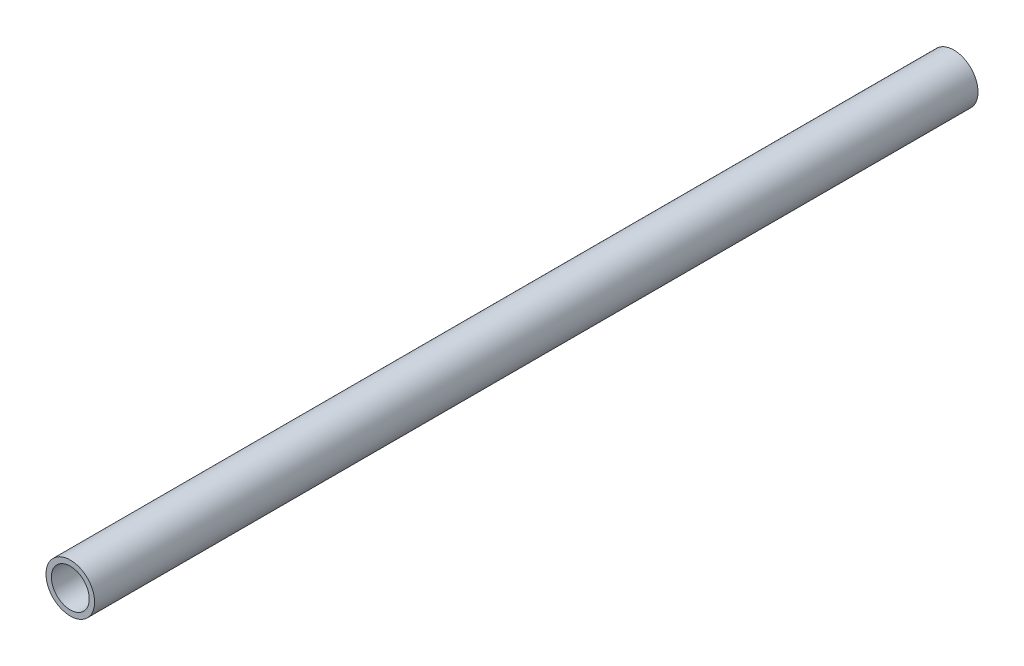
ISO-10303-21;
HEADER;
FILE_DESCRIPTION(('STEP AP214'),'2;1');
FILE_NAME('part.step','',(''),(''),'','','');
FILE_SCHEMA(('AUTOMOTIVE_DESIGN { 1 0 10303 214 1 1 1 1 }'));
ENDSEC;
DATA;
#1=APPLICATION_CONTEXT('core data for automotive mechanical design processes');
#2=APPLICATION_PROTOCOL_DEFINITION('international standard','automotive_design',2000,#1);
#3=PRODUCT_CONTEXT('',#1,'mechanical');
#4=PRODUCT('Part','Part','',(#3));
#5=PRODUCT_RELATED_PRODUCT_CATEGORY('part','',(#4));
#6=PRODUCT_DEFINITION_FORMATION('','',#4);
#7=PRODUCT_DEFINITION_CONTEXT('part definition',#1,'design');
#8=PRODUCT_DEFINITION('design','',#6,#7);
#9=PRODUCT_DEFINITION_SHAPE('','',#8);
#10=(LENGTH_UNIT() NAMED_UNIT(*) SI_UNIT(.MILLI.,.METRE.));
#11=(NAMED_UNIT(*) PLANE_ANGLE_UNIT() SI_UNIT($,.RADIAN.));
#12=(NAMED_UNIT(*) SI_UNIT($,.STERADIAN.) SOLID_ANGLE_UNIT());
#13=UNCERTAINTY_MEASURE_WITH_UNIT(LENGTH_MEASURE(1.E-05),#10,'distance_accuracy_value','');
#14=(GEOMETRIC_REPRESENTATION_CONTEXT(3) GLOBAL_UNCERTAINTY_ASSIGNED_CONTEXT((#13)) GLOBAL_UNIT_ASSIGNED_CONTEXT((#10,
#11,#12)) REPRESENTATION_CONTEXT('',''));
#15=CARTESIAN_POINT('',(0.,0.,0.));
#16=DIRECTION('',(0.,0.,1.));
#17=DIRECTION('',(1.,0.,0.));
#18=AXIS2_PLACEMENT_3D('',#15,#16,#17);
#19=CARTESIAN_POINT('',(0.,0.,304.8));
#20=DIRECTION('',(0.,0.,1.));
#21=DIRECTION('',(1.,0.,0.));
#22=AXIS2_PLACEMENT_3D('',#19,#20,#21);
#23=PLANE('',#22);
#24=CARTESIAN_POINT('',(0.,0.,304.8));
#25=DIRECTION('',(0.,0.,1.));
#26=DIRECTION('',(1.,0.,0.));
#27=AXIS2_PLACEMENT_3D('',#24,#25,#26);
#28=CIRCLE('',#27,16.764);
#29=CARTESIAN_POINT('',(-16.764,0.,304.8));
#30=VERTEX_POINT('',#29);
#31=EDGE_CURVE('E10',#30,#30,#28,.T.);
#32=ORIENTED_EDGE('',*,*,#31,.T.);
#33=EDGE_LOOP('',(#32));
#34=FACE_BOUND('',#33,.T.);
#35=CARTESIAN_POINT('',(0.,0.,304.8));
#36=DIRECTION('',(0.,0.,1.));
#37=DIRECTION('',(1.,0.,0.));
#38=AXIS2_PLACEMENT_3D('',#35,#36,#37);
#39=CIRCLE('',#38,13.081);
#40=CARTESIAN_POINT('',(-13.081,0.,304.8));
#41=VERTEX_POINT('',#40);
#42=EDGE_CURVE('E38',#41,#41,#39,.T.);
#43=ORIENTED_EDGE('',*,*,#42,.F.);
#44=EDGE_LOOP('',(#43));
#45=FACE_BOUND('',#44,.T.);
#46=ADVANCED_FACE('F27',(#34,#45),#23,.T.);
#47=CARTESIAN_POINT('',(0.,0.,-304.8));
#48=DIRECTION('',(0.,0.,1.));
#49=DIRECTION('',(1.,0.,0.));
#50=AXIS2_PLACEMENT_3D('',#47,#48,#49);
#51=PLANE('',#50);
#52=CARTESIAN_POINT('',(0.,0.,-304.8));
#53=DIRECTION('',(0.,0.,1.));
#54=DIRECTION('',(1.,0.,0.));
#55=AXIS2_PLACEMENT_3D('',#52,#53,#54);
#56=CIRCLE('',#55,16.764);
#57=CARTESIAN_POINT('',(-16.764,0.,-304.8));
#58=VERTEX_POINT('',#57);
#59=EDGE_CURVE('E34',#58,#58,#56,.T.);
#60=ORIENTED_EDGE('',*,*,#59,.F.);
#61=EDGE_LOOP('',(#60));
#62=FACE_BOUND('',#61,.T.);
#63=CARTESIAN_POINT('',(0.,0.,-304.8));
#64=DIRECTION('',(0.,0.,1.));
#65=DIRECTION('',(1.,0.,0.));
#66=AXIS2_PLACEMENT_3D('',#63,#64,#65);
#67=CIRCLE('',#66,13.081);
#68=CARTESIAN_POINT('',(-13.081,0.,-304.8));
#69=VERTEX_POINT('',#68);
#70=EDGE_CURVE('E42',#69,#69,#67,.T.);
#71=ORIENTED_EDGE('',*,*,#70,.T.);
#72=EDGE_LOOP('',(#71));
#73=FACE_BOUND('',#72,.T.);
#74=ADVANCED_FACE('F48',(#62,#73),#51,.F.);
#75=CARTESIAN_POINT('',(0.,0.,304.8));
#76=DIRECTION('',(0.,0.,-1.));
#77=DIRECTION('',(-1.,0.,0.));
#78=AXIS2_PLACEMENT_3D('',#75,#76,#77);
#79=CYLINDRICAL_SURFACE('',#78,16.764);
#80=CARTESIAN_POINT('',(-16.764,0.,304.8));
#81=CARTESIAN_POINT('',(-16.764,0.,298.45));
#82=CARTESIAN_POINT('',(-16.764,0.,292.1));
#83=CARTESIAN_POINT('',(-16.764,0.,279.4));
#84=CARTESIAN_POINT('',(-16.764,0.,273.05));
#85=CARTESIAN_POINT('',(-16.764,0.,260.35));
#86=CARTESIAN_POINT('',(-16.764,0.,254.));
#87=CARTESIAN_POINT('',(-16.764,0.,241.3));
#88=CARTESIAN_POINT('',(-16.764,0.,234.95));
#89=CARTESIAN_POINT('',(-16.764,0.,222.25));
#90=CARTESIAN_POINT('',(-16.764,0.,215.9));
#91=CARTESIAN_POINT('',(-16.764,0.,203.2));
#92=CARTESIAN_POINT('',(-16.764,0.,196.85));
#93=CARTESIAN_POINT('',(-16.764,0.,184.15));
#94=CARTESIAN_POINT('',(-16.764,0.,177.8));
#95=CARTESIAN_POINT('',(-16.764,0.,165.1));
#96=CARTESIAN_POINT('',(-16.764,0.,158.75));
#97=CARTESIAN_POINT('',(-16.764,0.,146.05));
#98=CARTESIAN_POINT('',(-16.764,0.,139.7));
#99=CARTESIAN_POINT('',(-16.764,0.,127.));
#100=CARTESIAN_POINT('',(-16.764,0.,120.65));
#101=CARTESIAN_POINT('',(-16.764,0.,107.95));
#102=CARTESIAN_POINT('',(-16.764,0.,101.6));
#103=CARTESIAN_POINT('',(-16.764,0.,88.9));
#104=CARTESIAN_POINT('',(-16.764,0.,82.55));
#105=CARTESIAN_POINT('',(-16.764,0.,69.85));
#106=CARTESIAN_POINT('',(-16.764,0.,63.5));
#107=CARTESIAN_POINT('',(-16.764,0.,50.8));
#108=CARTESIAN_POINT('',(-16.764,0.,44.45));
#109=CARTESIAN_POINT('',(-16.764,0.,31.75));
#110=CARTESIAN_POINT('',(-16.764,0.,25.4));
#111=CARTESIAN_POINT('',(-16.764,0.,12.7));
#112=CARTESIAN_POINT('',(-16.764,0.,6.35));
#113=CARTESIAN_POINT('',(-16.764,0.,-6.35));
#114=CARTESIAN_POINT('',(-16.764,0.,-12.7));
#115=CARTESIAN_POINT('',(-16.764,0.,-25.4));
#116=CARTESIAN_POINT('',(-16.764,0.,-31.75));
#117=CARTESIAN_POINT('',(-16.764,0.,-44.45));
#118=CARTESIAN_POINT('',(-16.764,0.,-50.8));
#119=CARTESIAN_POINT('',(-16.764,0.,-63.5));
#120=CARTESIAN_POINT('',(-16.764,0.,-69.85));
#121=CARTESIAN_POINT('',(-16.764,0.,-82.55));
#122=CARTESIAN_POINT('',(-16.764,0.,-88.9));
#123=CARTESIAN_POINT('',(-16.764,0.,-101.6));
#124=CARTESIAN_POINT('',(-16.764,0.,-107.95));
#125=CARTESIAN_POINT('',(-16.764,0.,-120.65));
#126=CARTESIAN_POINT('',(-16.764,0.,-127.));
#127=CARTESIAN_POINT('',(-16.764,0.,-139.7));
#128=CARTESIAN_POINT('',(-16.764,0.,-146.05));
#129=CARTESIAN_POINT('',(-16.764,0.,-158.75));
#130=CARTESIAN_POINT('',(-16.764,0.,-165.1));
#131=CARTESIAN_POINT('',(-16.764,0.,-177.8));
#132=CARTESIAN_POINT('',(-16.764,0.,-184.15));
#133=CARTESIAN_POINT('',(-16.764,0.,-196.85));
#134=CARTESIAN_POINT('',(-16.764,0.,-203.2));
#135=CARTESIAN_POINT('',(-16.764,0.,-215.9));
#136=CARTESIAN_POINT('',(-16.764,0.,-222.25));
#137=CARTESIAN_POINT('',(-16.764,0.,-234.95));
#138=CARTESIAN_POINT('',(-16.764,0.,-241.3));
#139=CARTESIAN_POINT('',(-16.764,0.,-254.));
#140=CARTESIAN_POINT('',(-16.764,0.,-260.35));
#141=CARTESIAN_POINT('',(-16.764,0.,-273.05));
#142=CARTESIAN_POINT('',(-16.764,0.,-279.4));
#143=CARTESIAN_POINT('',(-16.764,0.,-292.1));
#144=CARTESIAN_POINT('',(-16.764,0.,-298.45));
#145=CARTESIAN_POINT('',(-16.764,0.,-304.8));
#146=B_SPLINE_CURVE_WITH_KNOTS('',3,(#80,#81,#82,#83,#84,#85,#86,#87,#88,#89,#90,#91,#92,#93,
#94,#95,#96,#97,#98,#99,#100,#101,#102,#103,#104,#105,#106,#107,#108,#109,#110,#111,#112,#113,
#114,#115,#116,#117,#118,#119,#120,#121,#122,#123,#124,#125,#126,#127,#128,#129,#130,#131,#132,
#133,#134,#135,#136,#137,#138,#139,#140,#141,#142,#143,#144,#145),.UNSPECIFIED.,.F.,.F.,(4,2,2,
2,2,2,2,2,2,2,2,2,2,2,2,2,2,2,2,2,2,2,2,2,2,2,2,2,2,2,2,2,4),(0.,19.05,38.1,57.15,76.2,
95.2500000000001,114.3,133.35,152.4,171.45,190.5,209.55,228.6,247.65,266.7,285.75,304.8,323.85,
342.9,361.95,381.,400.05,419.1,438.15,457.2,476.25,495.3,514.35,533.4,552.45,571.5,590.55,
609.6),.UNSPECIFIED.);
#147=EDGE_CURVE('BSEAM29',#30,#58,#146,.T.);
#148=ORIENTED_EDGE('',*,*,#31,.F.);
#149=ORIENTED_EDGE('',*,*,#59,.T.);
#150=ORIENTED_EDGE('',*,*,#147,.T.);
#151=ORIENTED_EDGE('',*,*,#147,.F.);
#152=EDGE_LOOP('',(#148,#150,#149,#151));
#153=FACE_BOUND('',#152,.T.);
#154=ADVANCED_FACE('F29',(#153),#79,.T.);
#155=CARTESIAN_POINT('',(0.,0.,304.8));
#156=DIRECTION('',(0.,0.,-1.));
#157=DIRECTION('',(-1.,0.,0.));
#158=AXIS2_PLACEMENT_3D('',#155,#156,#157);
#159=CYLINDRICAL_SURFACE('',#158,13.081);
#160=CARTESIAN_POINT('',(-13.081,0.,304.8));
#161=CARTESIAN_POINT('',(-13.081,0.,298.45));
#162=CARTESIAN_POINT('',(-13.081,0.,292.1));
#163=CARTESIAN_POINT('',(-13.081,0.,279.4));
#164=CARTESIAN_POINT('',(-13.081,0.,273.05));
#165=CARTESIAN_POINT('',(-13.081,0.,260.35));
#166=CARTESIAN_POINT('',(-13.081,0.,254.));
#167=CARTESIAN_POINT('',(-13.081,0.,241.3));
#168=CARTESIAN_POINT('',(-13.081,0.,234.95));
#169=CARTESIAN_POINT('',(-13.081,0.,222.25));
#170=CARTESIAN_POINT('',(-13.081,0.,215.9));
#171=CARTESIAN_POINT('',(-13.081,0.,203.2));
#172=CARTESIAN_POINT('',(-13.081,0.,196.85));
#173=CARTESIAN_POINT('',(-13.081,0.,184.15));
#174=CARTESIAN_POINT('',(-13.081,0.,177.8));
#175=CARTESIAN_POINT('',(-13.081,0.,165.1));
#176=CARTESIAN_POINT('',(-13.081,0.,158.75));
#177=CARTESIAN_POINT('',(-13.081,0.,146.05));
#178=CARTESIAN_POINT('',(-13.081,0.,139.7));
#179=CARTESIAN_POINT('',(-13.081,0.,127.));
#180=CARTESIAN_POINT('',(-13.081,0.,120.65));
#181=CARTESIAN_POINT('',(-13.081,0.,107.95));
#182=CARTESIAN_POINT('',(-13.081,0.,101.6));
#183=CARTESIAN_POINT('',(-13.081,0.,88.9));
#184=CARTESIAN_POINT('',(-13.081,0.,82.55));
#185=CARTESIAN_POINT('',(-13.081,0.,69.85));
#186=CARTESIAN_POINT('',(-13.081,0.,63.5));
#187=CARTESIAN_POINT('',(-13.081,0.,50.8));
#188=CARTESIAN_POINT('',(-13.081,0.,44.45));
#189=CARTESIAN_POINT('',(-13.081,0.,31.75));
#190=CARTESIAN_POINT('',(-13.081,0.,25.4));
#191=CARTESIAN_POINT('',(-13.081,0.,12.7));
#192=CARTESIAN_POINT('',(-13.081,0.,6.34999999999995));
#193=CARTESIAN_POINT('',(-13.081,0.,-6.35000000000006));
#194=CARTESIAN_POINT('',(-13.081,0.,-12.7000000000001));
#195=CARTESIAN_POINT('',(-13.081,0.,-25.4000000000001));
#196=CARTESIAN_POINT('',(-13.081,0.,-31.7500000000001));
#197=CARTESIAN_POINT('',(-13.081,0.,-44.4500000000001));
#198=CARTESIAN_POINT('',(-13.081,0.,-50.8000000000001));
#199=CARTESIAN_POINT('',(-13.081,0.,-63.5000000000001));
#200=CARTESIAN_POINT('',(-13.081,0.,-69.8500000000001));
#201=CARTESIAN_POINT('',(-13.081,0.,-82.5500000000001));
#202=CARTESIAN_POINT('',(-13.081,0.,-88.9000000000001));
#203=CARTESIAN_POINT('',(-13.081,0.,-101.6));
#204=CARTESIAN_POINT('',(-13.081,0.,-107.95));
#205=CARTESIAN_POINT('',(-13.081,0.,-120.65));
#206=CARTESIAN_POINT('',(-13.081,0.,-127.));
#207=CARTESIAN_POINT('',(-13.081,0.,-139.7));
#208=CARTESIAN_POINT('',(-13.081,0.,-146.05));
#209=CARTESIAN_POINT('',(-13.081,0.,-158.75));
#210=CARTESIAN_POINT('',(-13.081,0.,-165.1));
#211=CARTESIAN_POINT('',(-13.081,0.,-177.8));
#212=CARTESIAN_POINT('',(-13.081,0.,-184.15));
#213=CARTESIAN_POINT('',(-13.081,0.,-196.85));
#214=CARTESIAN_POINT('',(-13.081,0.,-203.2));
#215=CARTESIAN_POINT('',(-13.081,0.,-215.9));
#216=CARTESIAN_POINT('',(-13.081,0.,-222.25));
#217=CARTESIAN_POINT('',(-13.081,0.,-234.95));
#218=CARTESIAN_POINT('',(-13.081,0.,-241.3));
#219=CARTESIAN_POINT('',(-13.081,0.,-254.));
#220=CARTESIAN_POINT('',(-13.081,0.,-260.35));
#221=CARTESIAN_POINT('',(-13.081,0.,-273.05));
#222=CARTESIAN_POINT('',(-13.081,0.,-279.4));
#223=CARTESIAN_POINT('',(-13.081,0.,-292.1));
#224=CARTESIAN_POINT('',(-13.081,0.,-298.45));
#225=CARTESIAN_POINT('',(-13.081,0.,-304.8));
#226=B_SPLINE_CURVE_WITH_KNOTS('',3,(#160,#161,#162,#163,#164,#165,#166,#167,#168,#169,#170,
#171,#172,#173,#174,#175,#176,#177,#178,#179,#180,#181,#182,#183,#184,#185,#186,#187,#188,#189,
#190,#191,#192,#193,#194,#195,#196,#197,#198,#199,#200,#201,#202,#203,#204,#205,#206,#207,#208,
#209,#210,#211,#212,#213,#214,#215,#216,#217,#218,#219,#220,#221,#222,#223,#224,#225),
.UNSPECIFIED.,.F.,.F.,(4,2,2,2,2,2,2,2,2,2,2,2,2,2,2,2,2,2,2,2,2,2,2,2,2,2,2,2,2,2,2,2,4),(0.,
19.05,38.1,57.15,76.2,95.25,114.3,133.35,152.4,171.45,190.5,209.55,228.6,247.65,266.7,285.75,
304.8,323.85,342.9,361.95,381.,400.05,419.1,438.15,457.2,476.25,495.3,514.35,533.4,552.45,571.5,
590.55,609.6),.UNSPECIFIED.);
#227=EDGE_CURVE('BSEAM50',#41,#69,#226,.T.);
#228=ORIENTED_EDGE('',*,*,#42,.T.);
#229=ORIENTED_EDGE('',*,*,#70,.F.);
#230=ORIENTED_EDGE('',*,*,#227,.T.);
#231=ORIENTED_EDGE('',*,*,#227,.F.);
#232=EDGE_LOOP('',(#228,#230,#229,#231));
#233=FACE_BOUND('',#232,.T.);
#234=ADVANCED_FACE('F50',(#233),#159,.F.);
#235=CLOSED_SHELL('',(#46,#74,#154,#234));
#236=MANIFOLD_SOLID_BREP('B2',#235);
#237=ADVANCED_BREP_SHAPE_REPRESENTATION('',(#18,#236),#14);
#238=SHAPE_DEFINITION_REPRESENTATION(#9,#237);
ENDSEC;
END-ISO-10303-21;
